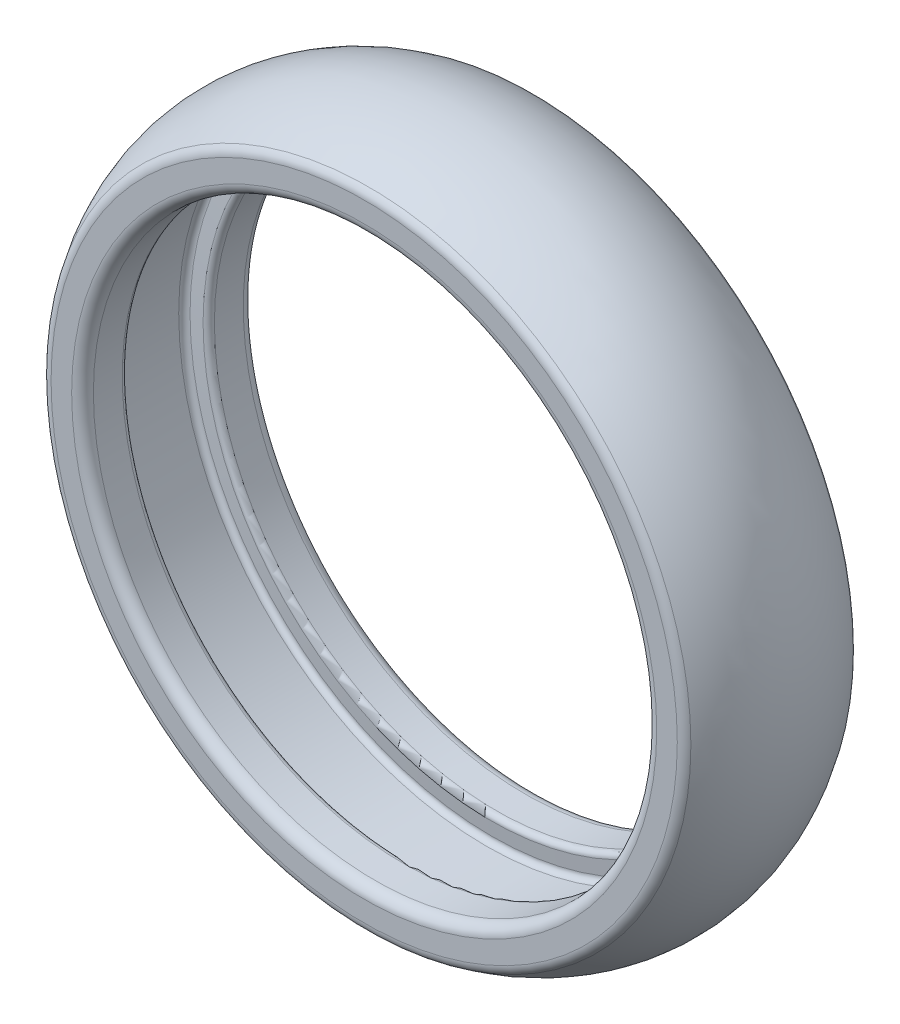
ISO-10303-21;
HEADER;
FILE_DESCRIPTION(('STEP AP214'),'2;1');
FILE_NAME('part.step','',(''),(''),'','','');
FILE_SCHEMA(('AUTOMOTIVE_DESIGN { 1 0 10303 214 1 1 1 1 }'));
ENDSEC;
DATA;
#1=APPLICATION_CONTEXT('core data for automotive mechanical design processes');
#2=APPLICATION_PROTOCOL_DEFINITION('international standard','automotive_design',2000,#1);
#3=PRODUCT_CONTEXT('',#1,'mechanical');
#4=PRODUCT('Part','Part','',(#3));
#5=PRODUCT_RELATED_PRODUCT_CATEGORY('part','',(#4));
#6=PRODUCT_DEFINITION_FORMATION('','',#4);
#7=PRODUCT_DEFINITION_CONTEXT('part definition',#1,'design');
#8=PRODUCT_DEFINITION('design','',#6,#7);
#9=PRODUCT_DEFINITION_SHAPE('','',#8);
#10=(LENGTH_UNIT() NAMED_UNIT(*) SI_UNIT(.MILLI.,.METRE.));
#11=(NAMED_UNIT(*) PLANE_ANGLE_UNIT() SI_UNIT($,.RADIAN.));
#12=(NAMED_UNIT(*) SI_UNIT($,.STERADIAN.) SOLID_ANGLE_UNIT());
#13=UNCERTAINTY_MEASURE_WITH_UNIT(LENGTH_MEASURE(1.E-05),#10,'distance_accuracy_value','');
#14=(GEOMETRIC_REPRESENTATION_CONTEXT(3) GLOBAL_UNCERTAINTY_ASSIGNED_CONTEXT((#13)) GLOBAL_UNIT_ASSIGNED_CONTEXT((#10,
#11,#12)) REPRESENTATION_CONTEXT('',''));
#15=CARTESIAN_POINT('',(0.,0.,0.));
#16=DIRECTION('',(0.,0.,1.));
#17=DIRECTION('',(1.,0.,0.));
#18=AXIS2_PLACEMENT_3D('',#15,#16,#17);
#19=CARTESIAN_POINT('',(0.,0.,0.));
#20=DIRECTION('',(0.,0.,1.));
#21=DIRECTION('',(1.,0.,0.));
#22=AXIS2_PLACEMENT_3D('',#19,#20,#21);
#23=CYLINDRICAL_SURFACE('',#22,28.3);
#24=CARTESIAN_POINT('',(0.,0.,-3.35434574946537));
#25=DIRECTION('',(0.,0.,1.));
#26=DIRECTION('',(1.,0.,0.));
#27=AXIS2_PLACEMENT_3D('',#24,#25,#26);
#28=CIRCLE('',#27,28.3);
#29=CARTESIAN_POINT('',(28.3,0.,-3.35434574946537));
#30=VERTEX_POINT('',#29);
#31=EDGE_CURVE('E123',#30,#30,#28,.F.);
#32=ORIENTED_EDGE('',*,*,#31,.T.);
#33=EDGE_LOOP('',(#32));
#34=FACE_BOUND('',#33,.T.);
#35=CARTESIAN_POINT('',(0.,0.,3.35434574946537));
#36=DIRECTION('',(0.,0.,1.));
#37=DIRECTION('',(1.,0.,0.));
#38=AXIS2_PLACEMENT_3D('',#35,#36,#37);
#39=CIRCLE('',#38,28.3);
#40=CARTESIAN_POINT('',(28.3,0.,3.35434574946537));
#41=VERTEX_POINT('',#40);
#42=EDGE_CURVE('E268',#41,#41,#39,.T.);
#43=ORIENTED_EDGE('',*,*,#42,.T.);
#44=EDGE_LOOP('',(#43));
#45=FACE_BOUND('',#44,.T.);
#46=ADVANCED_FACE('F14',(#34,#45),#23,.F.);
#47=CARTESIAN_POINT('',(0.,0.,-3.35434574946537));
#48=DIRECTION('',(0.,0.,1.));
#49=DIRECTION('',(1.,0.,0.));
#50=AXIS2_PLACEMENT_3D('',#47,#48,#49);
#51=TOROIDAL_SURFACE('',#50,27.8,0.5);
#52=CARTESIAN_POINT('',(0.,0.,-3.85244309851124));
#53=DIRECTION('',(0.,0.,-1.));
#54=DIRECTION('',(-1.,0.,0.));
#55=AXIS2_PLACEMENT_3D('',#52,#53,#54);
#56=CIRCLE('',#55,27.7564221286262);
#57=CARTESIAN_POINT('',(-27.7564221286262,0.,-3.85244309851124));
#58=VERTEX_POINT('',#57);
#59=EDGE_CURVE('E255',#58,#58,#56,.F.);
#60=ORIENTED_EDGE('',*,*,#59,.F.);
#61=EDGE_LOOP('',(#60));
#62=FACE_BOUND('',#61,.T.);
#63=ORIENTED_EDGE('',*,*,#31,.F.);
#64=EDGE_LOOP('',(#63));
#65=FACE_BOUND('',#64,.T.);
#66=ADVANCED_FACE('F263',(#62,#65),#51,.F.);
#67=CARTESIAN_POINT('',(0.,0.,3.35434574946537));
#68=DIRECTION('',(0.,0.,1.));
#69=DIRECTION('',(1.,0.,0.));
#70=AXIS2_PLACEMENT_3D('',#67,#68,#69);
#71=TOROIDAL_SURFACE('',#70,27.8,0.5);
#72=ORIENTED_EDGE('',*,*,#42,.F.);
#73=EDGE_LOOP('',(#72));
#74=FACE_BOUND('',#73,.T.);
#75=CARTESIAN_POINT('',(0.,0.,3.85244309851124));
#76=DIRECTION('',(0.,0.,1.));
#77=DIRECTION('',(1.,0.,0.));
#78=AXIS2_PLACEMENT_3D('',#75,#76,#77);
#79=CIRCLE('',#78,27.7564221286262);
#80=CARTESIAN_POINT('',(27.7564221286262,0.,3.85244309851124));
#81=VERTEX_POINT('',#80);
#82=EDGE_CURVE('E252',#81,#81,#79,.F.);
#83=ORIENTED_EDGE('',*,*,#82,.F.);
#84=EDGE_LOOP('',(#83));
#85=FACE_BOUND('',#84,.T.);
#86=ADVANCED_FACE('F260',(#74,#85),#71,.F.);
#87=CARTESIAN_POINT('',(0.,0.,-3.85244309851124));
#88=DIRECTION('',(0.,0.,-1.));
#89=DIRECTION('',(-1.,0.,0.));
#90=AXIS2_PLACEMENT_3D('',#87,#88,#89);
#91=CONICAL_SURFACE('',#90,27.7564221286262,1.48352986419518);
#92=ORIENTED_EDGE('',*,*,#59,.T.);
#93=EDGE_LOOP('',(#92));
#94=FACE_BOUND('',#93,.T.);
#95=CARTESIAN_POINT('',(0.,0.,-3.73758410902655));
#96=DIRECTION('',(0.,0.,-1.));
#97=DIRECTION('',(-1.,0.,0.));
#98=AXIS2_PLACEMENT_3D('',#95,#96,#97);
#99=CIRCLE('',#98,26.4435778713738);
#100=CARTESIAN_POINT('',(-26.4435778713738,0.,-3.73758410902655));
#101=VERTEX_POINT('',#100);
#102=EDGE_CURVE('E249',#101,#101,#99,.F.);
#103=ORIENTED_EDGE('',*,*,#102,.F.);
#104=EDGE_LOOP('',(#103));
#105=FACE_BOUND('',#104,.T.);
#106=ADVANCED_FACE('F262',(#94,#105),#91,.T.);
#107=CARTESIAN_POINT('',(0.,0.,3.85244309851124));
#108=DIRECTION('',(0.,0.,1.));
#109=DIRECTION('',(1.,0.,0.));
#110=AXIS2_PLACEMENT_3D('',#107,#108,#109);
#111=CONICAL_SURFACE('',#110,27.7564221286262,1.48352986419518);
#112=ORIENTED_EDGE('',*,*,#82,.T.);
#113=EDGE_LOOP('',(#112));
#114=FACE_BOUND('',#113,.T.);
#115=CARTESIAN_POINT('',(0.,0.,3.73758410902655));
#116=DIRECTION('',(0.,0.,-1.));
#117=DIRECTION('',(-1.,0.,0.));
#118=AXIS2_PLACEMENT_3D('',#115,#116,#117);
#119=CIRCLE('',#118,26.4435778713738);
#120=CARTESIAN_POINT('',(-26.4435778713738,0.,3.73758410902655));
#121=VERTEX_POINT('',#120);
#122=EDGE_CURVE('E246',#121,#121,#119,.T.);
#123=ORIENTED_EDGE('',*,*,#122,.F.);
#124=EDGE_LOOP('',(#123));
#125=FACE_BOUND('',#124,.T.);
#126=ADVANCED_FACE('F241',(#114,#125),#111,.T.);
#127=CARTESIAN_POINT('',(0.,0.,-4.23568145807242));
#128=DIRECTION('',(0.,0.,-1.));
#129=DIRECTION('',(-1.,0.,0.));
#130=AXIS2_PLACEMENT_3D('',#127,#128,#129);
#131=TOROIDAL_SURFACE('',#130,26.4,0.5);
#132=ORIENTED_EDGE('',*,*,#102,.T.);
#133=EDGE_LOOP('',(#132));
#134=FACE_BOUND('',#133,.T.);
#135=CARTESIAN_POINT('',(0.,0.,-4.23568145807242));
#136=DIRECTION('',(0.,0.,1.));
#137=DIRECTION('',(1.,0.,0.));
#138=AXIS2_PLACEMENT_3D('',#135,#136,#137);
#139=CIRCLE('',#138,25.9);
#140=CARTESIAN_POINT('',(25.9,0.,-4.23568145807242));
#141=VERTEX_POINT('',#140);
#142=EDGE_CURVE('E226',#141,#141,#139,.F.);
#143=ORIENTED_EDGE('',*,*,#142,.T.);
#144=EDGE_LOOP('',(#143));
#145=FACE_BOUND('',#144,.T.);
#146=ADVANCED_FACE('F236',(#134,#145),#131,.T.);
#147=CARTESIAN_POINT('',(0.,0.,4.23568145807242));
#148=DIRECTION('',(0.,0.,-1.));
#149=DIRECTION('',(-1.,0.,0.));
#150=AXIS2_PLACEMENT_3D('',#147,#148,#149);
#151=TOROIDAL_SURFACE('',#150,26.4,0.5);
#152=CARTESIAN_POINT('',(0.,0.,4.23568145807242));
#153=DIRECTION('',(0.,0.,1.));
#154=DIRECTION('',(1.,0.,0.));
#155=AXIS2_PLACEMENT_3D('',#152,#153,#154);
#156=CIRCLE('',#155,25.9);
#157=CARTESIAN_POINT('',(25.9,0.,4.23568145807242));
#158=VERTEX_POINT('',#157);
#159=EDGE_CURVE('E218',#158,#158,#156,.T.);
#160=ORIENTED_EDGE('',*,*,#159,.T.);
#161=EDGE_LOOP('',(#160));
#162=FACE_BOUND('',#161,.T.);
#163=ORIENTED_EDGE('',*,*,#122,.T.);
#164=EDGE_LOOP('',(#163));
#165=FACE_BOUND('',#164,.T.);
#166=ADVANCED_FACE('F231',(#162,#165),#151,.T.);
#167=CARTESIAN_POINT('',(0.,0.,0.));
#168=DIRECTION('',(0.,0.,1.));
#169=DIRECTION('',(1.,0.,0.));
#170=AXIS2_PLACEMENT_3D('',#167,#168,#169);
#171=CYLINDRICAL_SURFACE('',#170,25.9);
#172=CARTESIAN_POINT('',(0.,0.,-6.89002720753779));
#173=DIRECTION('',(0.,0.,1.));
#174=DIRECTION('',(1.,0.,0.));
#175=AXIS2_PLACEMENT_3D('',#172,#173,#174);
#176=CIRCLE('',#175,25.9);
#177=CARTESIAN_POINT('',(25.9,0.,-6.89002720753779));
#178=VERTEX_POINT('',#177);
#179=EDGE_CURVE('E215',#178,#178,#176,.T.);
#180=ORIENTED_EDGE('',*,*,#179,.F.);
#181=EDGE_LOOP('',(#180));
#182=FACE_BOUND('',#181,.T.);
#183=ORIENTED_EDGE('',*,*,#142,.F.);
#184=EDGE_LOOP('',(#183));
#185=FACE_BOUND('',#184,.T.);
#186=ADVANCED_FACE('F235',(#182,#185),#171,.F.);
#187=CARTESIAN_POINT('',(0.,0.,0.));
#188=DIRECTION('',(0.,0.,1.));
#189=DIRECTION('',(1.,0.,0.));
#190=AXIS2_PLACEMENT_3D('',#187,#188,#189);
#191=CYLINDRICAL_SURFACE('',#190,25.9);
#192=ORIENTED_EDGE('',*,*,#159,.F.);
#193=EDGE_LOOP('',(#192));
#194=FACE_BOUND('',#193,.T.);
#195=CARTESIAN_POINT('',(0.,0.,6.89002720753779));
#196=DIRECTION('',(0.,0.,-1.));
#197=DIRECTION('',(-1.,0.,0.));
#198=AXIS2_PLACEMENT_3D('',#195,#196,#197);
#199=CIRCLE('',#198,25.9);
#200=CARTESIAN_POINT('',(-25.9,0.,6.89002720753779));
#201=VERTEX_POINT('',#200);
#202=EDGE_CURVE('E62',#201,#201,#199,.T.);
#203=ORIENTED_EDGE('',*,*,#202,.F.);
#204=EDGE_LOOP('',(#203));
#205=FACE_BOUND('',#204,.T.);
#206=ADVANCED_FACE('F312',(#194,#205),#191,.F.);
#207=CARTESIAN_POINT('',(0.,0.,-6.89002720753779));
#208=DIRECTION('',(0.,0.,1.));
#209=DIRECTION('',(1.,0.,0.));
#210=AXIS2_PLACEMENT_3D('',#207,#208,#209);
#211=TOROIDAL_SURFACE('',#210,26.9,1.);
#212=CARTESIAN_POINT('',(0.,0.,-7.89002720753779));
#213=DIRECTION('',(0.,0.,-1.));
#214=DIRECTION('',(1.,0.,0.));
#215=AXIS2_PLACEMENT_3D('',#212,#213,#214);
#216=CIRCLE('',#215,26.9);
#217=CARTESIAN_POINT('',(26.9,0.,-7.89002720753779));
#218=VERTEX_POINT('',#217);
#219=CARTESIAN_POINT('',(-26.9,0.,-7.89002720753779));
#220=VERTEX_POINT('',#219);
#221=EDGE_CURVE('E57',#218,#220,#216,.T.);
#222=ORIENTED_EDGE('',*,*,#221,.T.);
#223=CARTESIAN_POINT('',(0.,0.,-7.89002720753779));
#224=DIRECTION('',(0.,0.,-1.));
#225=DIRECTION('',(-1.,0.,0.));
#226=AXIS2_PLACEMENT_3D('',#223,#224,#225);
#227=CIRCLE('',#226,26.9);
#228=EDGE_CURVE('E54',#220,#218,#227,.T.);
#229=ORIENTED_EDGE('',*,*,#228,.T.);
#230=EDGE_LOOP('',(#222,#229));
#231=FACE_BOUND('',#230,.T.);
#232=ORIENTED_EDGE('',*,*,#179,.T.);
#233=EDGE_LOOP('',(#232));
#234=FACE_BOUND('',#233,.T.);
#235=ADVANCED_FACE('F58',(#231,#234),#211,.T.);
#236=CARTESIAN_POINT('',(0.,0.,6.89002720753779));
#237=DIRECTION('',(0.,0.,-1.));
#238=DIRECTION('',(-1.,0.,0.));
#239=AXIS2_PLACEMENT_3D('',#236,#237,#238);
#240=TOROIDAL_SURFACE('',#239,26.9,1.);
#241=CARTESIAN_POINT('',(0.,0.,7.89002720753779));
#242=DIRECTION('',(0.,0.,1.));
#243=DIRECTION('',(-1.,0.,0.));
#244=AXIS2_PLACEMENT_3D('',#241,#242,#243);
#245=CIRCLE('',#244,26.9);
#246=CARTESIAN_POINT('',(-26.9,0.,7.89002720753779));
#247=VERTEX_POINT('',#246);
#248=CARTESIAN_POINT('',(26.9,0.,7.89002720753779));
#249=VERTEX_POINT('',#248);
#250=EDGE_CURVE('E67',#247,#249,#245,.T.);
#251=ORIENTED_EDGE('',*,*,#250,.T.);
#252=CARTESIAN_POINT('',(0.,0.,7.89002720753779));
#253=DIRECTION('',(0.,0.,1.));
#254=DIRECTION('',(1.,0.,0.));
#255=AXIS2_PLACEMENT_3D('',#252,#253,#254);
#256=CIRCLE('',#255,26.9);
#257=EDGE_CURVE('E114',#249,#247,#256,.T.);
#258=ORIENTED_EDGE('',*,*,#257,.T.);
#259=EDGE_LOOP('',(#251,#258));
#260=FACE_BOUND('',#259,.T.);
#261=ORIENTED_EDGE('',*,*,#202,.T.);
#262=EDGE_LOOP('',(#261));
#263=FACE_BOUND('',#262,.T.);
#264=ADVANCED_FACE('F88',(#260,#263),#240,.T.);
#265=CARTESIAN_POINT('',(0.,29.3,-7.89002720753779));
#266=DIRECTION('',(0.,0.,1.));
#267=DIRECTION('',(1.,0.,0.));
#268=AXIS2_PLACEMENT_3D('',#265,#266,#267);
#269=PLANE('',#268);
#270=ORIENTED_EDGE('',*,*,#221,.F.);
#271=ORIENTED_EDGE('',*,*,#228,.F.);
#272=EDGE_LOOP('',(#270,#271));
#273=FACE_BOUND('',#272,.T.);
#274=CARTESIAN_POINT('',(0.,0.,-7.89002720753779));
#275=DIRECTION('',(0.,0.,1.));
#276=DIRECTION('',(1.,0.,0.));
#277=AXIS2_PLACEMENT_3D('',#274,#275,#276);
#278=CIRCLE('',#277,28.7909870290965);
#279=CARTESIAN_POINT('',(28.7909870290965,0.,-7.89002720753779));
#280=VERTEX_POINT('',#279);
#281=CARTESIAN_POINT('',(-28.7909870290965,0.,-7.89002720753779));
#282=VERTEX_POINT('',#281);
#283=EDGE_CURVE('E111',#280,#282,#278,.T.);
#284=ORIENTED_EDGE('',*,*,#283,.F.);
#285=CARTESIAN_POINT('',(0.,0.,-7.89002720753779));
#286=DIRECTION('',(0.,0.,1.));
#287=DIRECTION('',(-1.,0.,0.));
#288=AXIS2_PLACEMENT_3D('',#285,#286,#287);
#289=CIRCLE('',#288,28.7909870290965);
#290=EDGE_CURVE('E110',#282,#280,#289,.T.);
#291=ORIENTED_EDGE('',*,*,#290,.F.);
#292=EDGE_LOOP('',(#284,#291));
#293=FACE_BOUND('',#292,.T.);
#294=ADVANCED_FACE('F65',(#273,#293),#269,.F.);
#295=CARTESIAN_POINT('',(0.,29.3,7.89002720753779));
#296=DIRECTION('',(0.,0.,-1.));
#297=DIRECTION('',(-1.,0.,0.));
#298=AXIS2_PLACEMENT_3D('',#295,#296,#297);
#299=PLANE('',#298);
#300=ORIENTED_EDGE('',*,*,#250,.F.);
#301=ORIENTED_EDGE('',*,*,#257,.F.);
#302=EDGE_LOOP('',(#300,#301));
#303=FACE_BOUND('',#302,.T.);
#304=CARTESIAN_POINT('',(0.,0.,7.89002720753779));
#305=DIRECTION('',(0.,0.,-1.));
#306=DIRECTION('',(-1.,0.,0.));
#307=AXIS2_PLACEMENT_3D('',#304,#305,#306);
#308=CIRCLE('',#307,28.7909870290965);
#309=CARTESIAN_POINT('',(-28.7909870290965,0.,7.89002720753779));
#310=VERTEX_POINT('',#309);
#311=CARTESIAN_POINT('',(28.7909870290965,0.,7.89002720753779));
#312=VERTEX_POINT('',#311);
#313=EDGE_CURVE('E116',#310,#312,#308,.T.);
#314=ORIENTED_EDGE('',*,*,#313,.F.);
#315=CARTESIAN_POINT('',(0.,0.,7.89002720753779));
#316=DIRECTION('',(0.,0.,-1.));
#317=DIRECTION('',(1.,0.,0.));
#318=AXIS2_PLACEMENT_3D('',#315,#316,#317);
#319=CIRCLE('',#318,28.7909870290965);
#320=EDGE_CURVE('E33',#312,#310,#319,.T.);
#321=ORIENTED_EDGE('',*,*,#320,.F.);
#322=EDGE_LOOP('',(#314,#321));
#323=FACE_BOUND('',#322,.T.);
#324=ADVANCED_FACE('F87',(#303,#323),#299,.F.);
#325=CARTESIAN_POINT('',(0.,0.,-6.89002720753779));
#326=DIRECTION('',(0.,0.,1.));
#327=DIRECTION('',(1.,0.,0.));
#328=AXIS2_PLACEMENT_3D('',#325,#326,#327);
#329=TOROIDAL_SURFACE('',#328,28.7909870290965,1.);
#330=CARTESIAN_POINT('',(0.,0.,-7.46161376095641));
#331=DIRECTION('',(0.,0.,1.));
#332=DIRECTION('',(1.,0.,0.));
#333=AXIS2_PLACEMENT_3D('',#330,#331,#332);
#334=CIRCLE('',#333,29.6115288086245);
#335=CARTESIAN_POINT('',(29.6115288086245,0.,-7.46161376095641));
#336=VERTEX_POINT('',#335);
#337=EDGE_CURVE('E25',#336,#336,#334,.T.);
#338=ORIENTED_EDGE('',*,*,#337,.F.);
#339=EDGE_LOOP('',(#338));
#340=FACE_BOUND('',#339,.T.);
#341=ORIENTED_EDGE('',*,*,#283,.T.);
#342=ORIENTED_EDGE('',*,*,#290,.T.);
#343=EDGE_LOOP('',(#341,#342));
#344=FACE_BOUND('',#343,.T.);
#345=ADVANCED_FACE('F115',(#340,#344),#329,.T.);
#346=CARTESIAN_POINT('',(0.,0.,6.89002720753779));
#347=DIRECTION('',(0.,0.,-1.));
#348=DIRECTION('',(-1.,0.,0.));
#349=AXIS2_PLACEMENT_3D('',#346,#347,#348);
#350=TOROIDAL_SURFACE('',#349,28.7909870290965,1.);
#351=CARTESIAN_POINT('',(0.,0.,7.46161376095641));
#352=DIRECTION('',(0.,0.,1.));
#353=DIRECTION('',(1.,0.,0.));
#354=AXIS2_PLACEMENT_3D('',#351,#352,#353);
#355=CIRCLE('',#354,29.6115288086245);
#356=CARTESIAN_POINT('',(29.6115288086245,0.,7.46161376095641));
#357=VERTEX_POINT('',#356);
#358=EDGE_CURVE('E9',#357,#357,#355,.F.);
#359=ORIENTED_EDGE('',*,*,#358,.F.);
#360=EDGE_LOOP('',(#359));
#361=FACE_BOUND('',#360,.T.);
#362=ORIENTED_EDGE('',*,*,#313,.T.);
#363=ORIENTED_EDGE('',*,*,#320,.T.);
#364=EDGE_LOOP('',(#362,#363));
#365=FACE_BOUND('',#364,.T.);
#366=ADVANCED_FACE('F119',(#361,#365),#350,.T.);
#367=CARTESIAN_POINT('',(0.,0.,0.));
#368=DIRECTION('',(0.,0.,1.));
#369=DIRECTION('',(1.,0.,0.));
#370=AXIS2_PLACEMENT_3D('',#367,#368,#369);
#371=TOROIDAL_SURFACE('',#370,18.9,13.0542150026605);
#372=ORIENTED_EDGE('',*,*,#358,.T.);
#373=EDGE_LOOP('',(#372));
#374=FACE_BOUND('',#373,.T.);
#375=ORIENTED_EDGE('',*,*,#337,.T.);
#376=EDGE_LOOP('',(#375));
#377=FACE_BOUND('',#376,.T.);
#378=ADVANCED_FACE('F138',(#374,#377),#371,.T.);
#379=CLOSED_SHELL('',(#46,#66,#86,#106,#126,#146,#166,#186,#206,#235,#264,#294,#324,#345,#366,#378));
#380=MANIFOLD_SOLID_BREP('B1',#379);
#381=ADVANCED_BREP_SHAPE_REPRESENTATION('',(#18,#380),#14);
#382=SHAPE_DEFINITION_REPRESENTATION(#9,#381);
ENDSEC;
END-ISO-10303-21;
